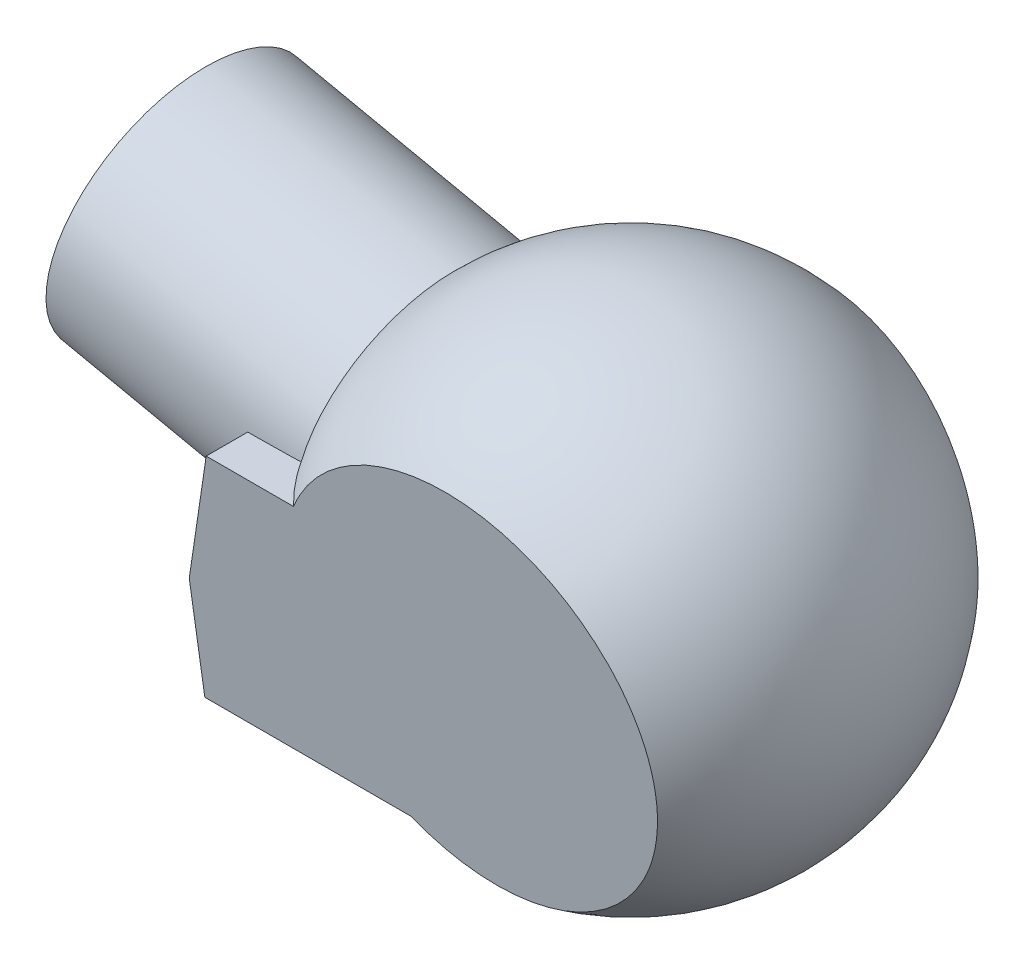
from build123d import *

# Parameters (mm, degrees)
EXTRUDE1_DEPTH     = 127
EXTRUDE2_DEPTH     = 12.7
CHAMFER1_SIZE      = 58.42
CHAMFER1_SIZE2     = 15.653591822
CUT_EXTRUDE1_DEPTH = 291.924264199


with BuildPart() as part:
    # Sketch1 → Revolve1 (revolve)
    with BuildSketch(Plane.XY):
        with BuildLine():
            Line((-107.95, 0), (107.95, 0))
            ThreePointArc((107.95, 0), (0, 107.95), (-107.95, 0))
        make_face()
    revolve(axis=Axis((-107.95, 0, 0), (1, 0, 0)))

    # Sketch2 → Extrude1 (add)
    with BuildSketch(Plane(origin=(0, 0, 0), x_dir=(0, 0, -1), z_dir=(1, 0, 0))):
        with BuildLine():
            Line((-75.38428728, 25.4), (75.38428728, 25.4))
            Line((75.38428728, 25.4), (60.325, -81.752396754))
            ThreePointArc((60.325, -81.752396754), (0, -101.6), (-60.325, -81.752396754))
            Line((-60.325, -81.752396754), (-75.38428728, 25.4))
        make_face()
    extrude(amount=-EXTRUDE1_DEPTH)

    # Sketch3 → Extrude2 (add, symmetric)
    with BuildSketch(Plane.XY):
        with BuildLine():
            Line((12.7, -95.25), (-35.56, -131.445))
            ThreePointArc((-35.56, -131.445), (-45.534709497, -132.344418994), (-50.8, -123.825))
            Line((-50.8, -123.825), (-50.8, -95.25))
            Line((-50.8, -95.25), (12.7, -95.25))
        make_face()
    extrude(amount=EXTRUDE2_DEPTH, both=True)

    # Chamfer1
    chamfer1_edges = [part.edges().sort_by_distance(p)[0] for p in [
        (-127, 25.4, 0),
    ]]
    chamfer1_side = [part.faces().sort_by_distance(p)[0] for p in [
        (-127, -32.603295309, 0),
    ]]
    chamfer(chamfer1_edges, length=CHAMFER1_SIZE, length2=CHAMFER1_SIZE2, reference=chamfer1_side[0])

    # Sketch5 → Revolve3 (revolve)
    with BuildSketch(Plane.XY):
        Polygon((0, 0), (-198.759592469, 42.247655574), (-186.877439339, 98.148790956), (11.88215313, 55.901135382), align=None)
    revolve(axis=Axis((0, 0, 0), (-0.9781476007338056, 0.2079116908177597, 0)))

    # Sketch6 → Cut-Extrude1 (cut, through all)
    with BuildSketch(Plane.ZY.offset(127)):
        with BuildLine():
            Line((59.120714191, -90.321335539), (81.72641209, 70.526562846))
            ThreePointArc((81.72641209, 70.526562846), (106.899438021, -15.023736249), (59.120714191, -90.321335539))
        make_face()
        with BuildLine():
            Line((-59.120714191, -90.321335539), (-81.72641209, 70.526562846))
            ThreePointArc((-81.72641209, 70.526562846), (-106.899438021, -15.023736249), (-59.120714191, -90.321335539))
        make_face()
    extrude(amount=-CUT_EXTRUDE1_DEPTH, mode=Mode.SUBTRACT)


solid = part.part
